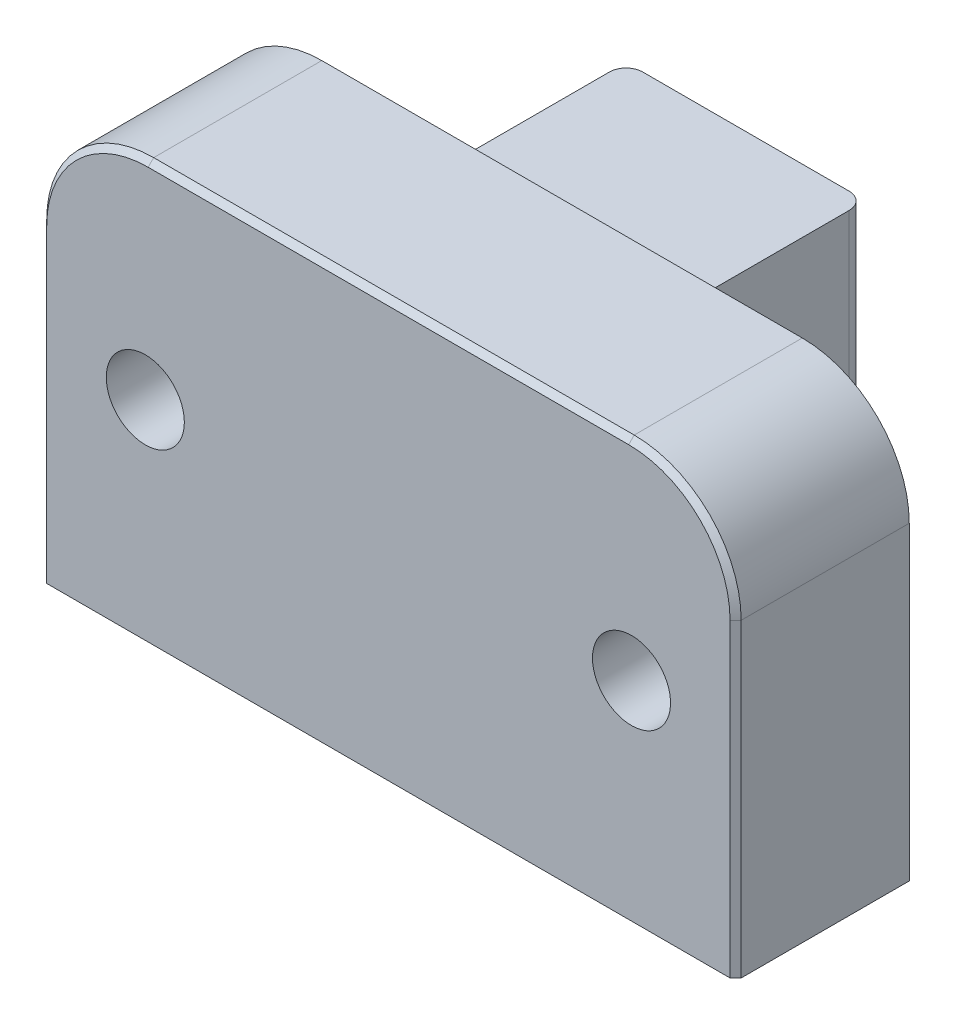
ISO-10303-21;
HEADER;
FILE_DESCRIPTION(('STEP AP214'),'2;1');
FILE_NAME('part.step','',(''),(''),'','','');
FILE_SCHEMA(('AUTOMOTIVE_DESIGN { 1 0 10303 214 1 1 1 1 }'));
ENDSEC;
DATA;
#1=APPLICATION_CONTEXT('core data for automotive mechanical design processes');
#2=APPLICATION_PROTOCOL_DEFINITION('international standard','automotive_design',2000,#1);
#3=PRODUCT_CONTEXT('',#1,'mechanical');
#4=PRODUCT('Part','Part','',(#3));
#5=PRODUCT_RELATED_PRODUCT_CATEGORY('part','',(#4));
#6=PRODUCT_DEFINITION_FORMATION('','',#4);
#7=PRODUCT_DEFINITION_CONTEXT('part definition',#1,'design');
#8=PRODUCT_DEFINITION('design','',#6,#7);
#9=PRODUCT_DEFINITION_SHAPE('','',#8);
#10=(LENGTH_UNIT() NAMED_UNIT(*) SI_UNIT(.MILLI.,.METRE.));
#11=(NAMED_UNIT(*) PLANE_ANGLE_UNIT() SI_UNIT($,.RADIAN.));
#12=(NAMED_UNIT(*) SI_UNIT($,.STERADIAN.) SOLID_ANGLE_UNIT());
#13=UNCERTAINTY_MEASURE_WITH_UNIT(LENGTH_MEASURE(1.E-05),#10,'distance_accuracy_value','');
#14=(GEOMETRIC_REPRESENTATION_CONTEXT(3) GLOBAL_UNCERTAINTY_ASSIGNED_CONTEXT((#13)) GLOBAL_UNIT_ASSIGNED_CONTEXT((#10,
#11,#12)) REPRESENTATION_CONTEXT('',''));
#15=CARTESIAN_POINT('',(0.,0.,0.));
#16=DIRECTION('',(0.,0.,1.));
#17=DIRECTION('',(1.,0.,0.));
#18=AXIS2_PLACEMENT_3D('',#15,#16,#17);
#19=CARTESIAN_POINT('',(-31.74365,38.1,0.));
#20=DIRECTION('',(1.,0.,0.));
#21=DIRECTION('',(0.,0.,-1.));
#22=AXIS2_PLACEMENT_3D('',#19,#20,#21);
#23=PLANE('',#22);
#24=DIRECTION('',(0.,0.,1.));
#25=VECTOR('',#24,1.);
#26=CARTESIAN_POINT('',(-31.74365,0.,0.));
#27=LINE('',#26,#25);
#28=CARTESIAN_POINT('',(-31.74365,0.,0.));
#29=VERTEX_POINT('',#28);
#30=CARTESIAN_POINT('',(-31.74365,0.,15.367));
#31=VERTEX_POINT('',#30);
#32=EDGE_CURVE('E178',#29,#31,#27,.T.);
#33=ORIENTED_EDGE('',*,*,#32,.T.);
#34=DIRECTION('',(0.,1.,0.));
#35=VECTOR('',#34,1.);
#36=CARTESIAN_POINT('',(-31.74365,38.1,15.367));
#37=LINE('',#36,#35);
#38=CARTESIAN_POINT('',(-31.74365,28.321,15.367));
#39=VERTEX_POINT('',#38);
#40=EDGE_CURVE('E252',#31,#39,#37,.T.);
#41=ORIENTED_EDGE('',*,*,#40,.T.);
#42=DIRECTION('',(0.,0.,1.));
#43=VECTOR('',#42,1.);
#44=CARTESIAN_POINT('',(-31.74365,28.321,0.));
#45=LINE('',#44,#43);
#46=CARTESIAN_POINT('',(-31.74365,28.321,0.));
#47=VERTEX_POINT('',#46);
#48=EDGE_CURVE('E235',#39,#47,#45,.F.);
#49=ORIENTED_EDGE('',*,*,#48,.T.);
#50=DIRECTION('',(0.,-1.,0.));
#51=VECTOR('',#50,1.);
#52=CARTESIAN_POINT('',(-31.74365,38.1,0.));
#53=LINE('',#52,#51);
#54=EDGE_CURVE('E173',#47,#29,#53,.T.);
#55=ORIENTED_EDGE('',*,*,#54,.T.);
#56=EDGE_LOOP('',(#33,#41,#49,#55));
#57=FACE_BOUND('',#56,.T.);
#58=ADVANCED_FACE('F32',(#57),#23,.F.);
#59=CARTESIAN_POINT('',(-31.74365,38.1,15.875));
#60=DIRECTION('',(0.,0.,-1.));
#61=DIRECTION('',(-1.,0.,0.));
#62=AXIS2_PLACEMENT_3D('',#59,#60,#61);
#63=PLANE('',#62);
#64=CARTESIAN_POINT('',(22.225,19.05,15.875));
#65=DIRECTION('',(0.,0.,-1.));
#66=DIRECTION('',(-1.,0.,0.));
#67=AXIS2_PLACEMENT_3D('',#64,#65,#66);
#68=CIRCLE('',#67,3.5687);
#69=CARTESIAN_POINT('',(18.6563,19.05,15.875));
#70=VERTEX_POINT('',#69);
#71=EDGE_CURVE('E284',#70,#70,#68,.T.);
#72=ORIENTED_EDGE('',*,*,#71,.T.);
#73=EDGE_LOOP('',(#72));
#74=FACE_BOUND('',#73,.T.);
#75=CARTESIAN_POINT('',(-22.225,19.05,15.875));
#76=DIRECTION('',(0.,0.,1.));
#77=DIRECTION('',(1.,0.,0.));
#78=AXIS2_PLACEMENT_3D('',#75,#76,#77);
#79=CIRCLE('',#78,3.5687);
#80=CARTESIAN_POINT('',(-18.6563,19.05,15.875));
#81=VERTEX_POINT('',#80);
#82=EDGE_CURVE('E296',#81,#81,#79,.T.);
#83=ORIENTED_EDGE('',*,*,#82,.F.);
#84=EDGE_LOOP('',(#83));
#85=FACE_BOUND('',#84,.T.);
#86=CARTESIAN_POINT('',(-21.96465,28.321,15.875));
#87=DIRECTION('',(0.,0.,-1.));
#88=DIRECTION('',(-1.,0.,0.));
#89=AXIS2_PLACEMENT_3D('',#86,#87,#88);
#90=CIRCLE('',#89,9.271);
#91=CARTESIAN_POINT('',(-21.96465,37.592,15.875));
#92=VERTEX_POINT('',#91);
#93=CARTESIAN_POINT('',(-31.23565,28.321,15.875));
#94=VERTEX_POINT('',#93);
#95=EDGE_CURVE('E243',#92,#94,#90,.F.);
#96=ORIENTED_EDGE('',*,*,#95,.T.);
#97=DIRECTION('',(0.,-1.,0.));
#98=VECTOR('',#97,1.);
#99=CARTESIAN_POINT('',(-31.23565,38.1,15.875));
#100=LINE('',#99,#98);
#101=CARTESIAN_POINT('',(-31.23565,0.,15.875));
#102=VERTEX_POINT('',#101);
#103=EDGE_CURVE('E245',#94,#102,#100,.T.);
#104=ORIENTED_EDGE('',*,*,#103,.T.);
#105=DIRECTION('',(1.,0.,0.));
#106=VECTOR('',#105,1.);
#107=CARTESIAN_POINT('',(-31.74365,0.,15.875));
#108=LINE('',#107,#106);
#109=CARTESIAN_POINT('',(31.23565,0.,15.875));
#110=VERTEX_POINT('',#109);
#111=EDGE_CURVE('E162',#102,#110,#108,.T.);
#112=ORIENTED_EDGE('',*,*,#111,.T.);
#113=DIRECTION('',(0.,1.,0.));
#114=VECTOR('',#113,1.);
#115=CARTESIAN_POINT('',(31.23565,38.1,15.875));
#116=LINE('',#115,#114);
#117=CARTESIAN_POINT('',(31.23565,28.321,15.875));
#118=VERTEX_POINT('',#117);
#119=EDGE_CURVE('E237',#110,#118,#116,.T.);
#120=ORIENTED_EDGE('',*,*,#119,.T.);
#121=CARTESIAN_POINT('',(21.96465,28.321,15.875));
#122=DIRECTION('',(0.,0.,-1.));
#123=DIRECTION('',(-1.,0.,0.));
#124=AXIS2_PLACEMENT_3D('',#121,#122,#123);
#125=CIRCLE('',#124,9.271);
#126=CARTESIAN_POINT('',(21.96465,37.592,15.875));
#127=VERTEX_POINT('',#126);
#128=EDGE_CURVE('E239',#118,#127,#125,.F.);
#129=ORIENTED_EDGE('',*,*,#128,.T.);
#130=DIRECTION('',(-1.,0.,0.));
#131=VECTOR('',#130,1.);
#132=CARTESIAN_POINT('',(-21.96465,37.592,15.875));
#133=LINE('',#132,#131);
#134=EDGE_CURVE('E241',#127,#92,#133,.T.);
#135=ORIENTED_EDGE('',*,*,#134,.T.);
#136=EDGE_LOOP('',(#96,#104,#112,#120,#129,#135));
#137=FACE_BOUND('',#136,.T.);
#138=ADVANCED_FACE('F322',(#74,#85,#137),#63,.F.);
#139=CARTESIAN_POINT('',(31.74365,38.1,0.));
#140=DIRECTION('',(-1.,0.,0.));
#141=DIRECTION('',(0.,0.,1.));
#142=AXIS2_PLACEMENT_3D('',#139,#140,#141);
#143=PLANE('',#142);
#144=DIRECTION('',(0.,0.,-1.));
#145=VECTOR('',#144,1.);
#146=CARTESIAN_POINT('',(31.74365,28.321,15.875));
#147=LINE('',#146,#145);
#148=CARTESIAN_POINT('',(31.74365,28.321,0.));
#149=VERTEX_POINT('',#148);
#150=CARTESIAN_POINT('',(31.74365,28.321,15.367));
#151=VERTEX_POINT('',#150);
#152=EDGE_CURVE('E233',#149,#151,#147,.F.);
#153=ORIENTED_EDGE('',*,*,#152,.T.);
#154=DIRECTION('',(0.,-1.,0.));
#155=VECTOR('',#154,1.);
#156=CARTESIAN_POINT('',(31.74365,38.1,15.367));
#157=LINE('',#156,#155);
#158=CARTESIAN_POINT('',(31.74365,0.,15.367));
#159=VERTEX_POINT('',#158);
#160=EDGE_CURVE('E11',#151,#159,#157,.T.);
#161=ORIENTED_EDGE('',*,*,#160,.T.);
#162=DIRECTION('',(0.,0.,-1.));
#163=VECTOR('',#162,1.);
#164=CARTESIAN_POINT('',(31.74365,0.,0.));
#165=LINE('',#164,#163);
#166=CARTESIAN_POINT('',(31.74365,0.,0.));
#167=VERTEX_POINT('',#166);
#168=EDGE_CURVE('E153',#159,#167,#165,.T.);
#169=ORIENTED_EDGE('',*,*,#168,.T.);
#170=DIRECTION('',(0.,-1.,0.));
#171=VECTOR('',#170,1.);
#172=CARTESIAN_POINT('',(31.74365,38.1,0.));
#173=LINE('',#172,#171);
#174=EDGE_CURVE('E156',#149,#167,#173,.T.);
#175=ORIENTED_EDGE('',*,*,#174,.F.);
#176=EDGE_LOOP('',(#153,#161,#169,#175));
#177=FACE_BOUND('',#176,.T.);
#178=ADVANCED_FACE('F155',(#177),#143,.F.);
#179=CARTESIAN_POINT('',(10.9601,38.1,-16.8148));
#180=DIRECTION('',(-1.,0.,0.));
#181=DIRECTION('',(0.,0.,1.));
#182=AXIS2_PLACEMENT_3D('',#179,#180,#181);
#183=PLANE('',#182);
#184=DIRECTION('',(0.,0.,1.));
#185=VECTOR('',#184,1.);
#186=CARTESIAN_POINT('',(10.9601,35.052,-16.8148));
#187=LINE('',#186,#185);
#188=CARTESIAN_POINT('',(10.9601,35.052,-15.2908));
#189=VERTEX_POINT('',#188);
#190=CARTESIAN_POINT('',(10.9601,35.052,-0.787400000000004));
#191=VERTEX_POINT('',#190);
#192=EDGE_CURVE('E306',#189,#191,#187,.T.);
#193=ORIENTED_EDGE('',*,*,#192,.T.);
#194=DIRECTION('',(0.,-1.,0.));
#195=VECTOR('',#194,1.);
#196=CARTESIAN_POINT('',(10.9601,3.048,-0.787400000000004));
#197=LINE('',#196,#195);
#198=CARTESIAN_POINT('',(10.9601,3.048,-0.787400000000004));
#199=VERTEX_POINT('',#198);
#200=EDGE_CURVE('E213',#191,#199,#197,.T.);
#201=ORIENTED_EDGE('',*,*,#200,.T.);
#202=DIRECTION('',(0.,0.,-1.));
#203=VECTOR('',#202,1.);
#204=CARTESIAN_POINT('',(10.9601,3.048,-16.8148));
#205=LINE('',#204,#203);
#206=CARTESIAN_POINT('',(10.9601,3.048,-15.2908));
#207=VERTEX_POINT('',#206);
#208=EDGE_CURVE('E317',#199,#207,#205,.T.);
#209=ORIENTED_EDGE('',*,*,#208,.T.);
#210=DIRECTION('',(0.,-1.,0.));
#211=VECTOR('',#210,1.);
#212=CARTESIAN_POINT('',(10.9601,38.1,-15.2908));
#213=LINE('',#212,#211);
#214=EDGE_CURVE('E195',#207,#189,#213,.F.);
#215=ORIENTED_EDGE('',*,*,#214,.T.);
#216=EDGE_LOOP('',(#193,#201,#209,#215));
#217=FACE_BOUND('',#216,.T.);
#218=ADVANCED_FACE('F400',(#217),#183,.F.);
#219=CARTESIAN_POINT('',(-10.9601,38.1,-16.8148));
#220=DIRECTION('',(0.,0.,1.));
#221=DIRECTION('',(1.,0.,0.));
#222=AXIS2_PLACEMENT_3D('',#219,#220,#221);
#223=PLANE('',#222);
#224=DIRECTION('',(1.,0.,0.));
#225=VECTOR('',#224,1.);
#226=CARTESIAN_POINT('',(-10.9601,35.052,-16.8148));
#227=LINE('',#226,#225);
#228=CARTESIAN_POINT('',(-9.43609999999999,35.052,-16.8148));
#229=VERTEX_POINT('',#228);
#230=CARTESIAN_POINT('',(9.43610000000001,35.052,-16.8148));
#231=VERTEX_POINT('',#230);
#232=EDGE_CURVE('E303',#229,#231,#227,.T.);
#233=ORIENTED_EDGE('',*,*,#232,.T.);
#234=DIRECTION('',(0.,-1.,0.));
#235=VECTOR('',#234,1.);
#236=CARTESIAN_POINT('',(9.43610000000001,38.1,-16.8148));
#237=LINE('',#236,#235);
#238=CARTESIAN_POINT('',(9.43610000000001,3.048,-16.8148));
#239=VERTEX_POINT('',#238);
#240=EDGE_CURVE('E187',#231,#239,#237,.T.);
#241=ORIENTED_EDGE('',*,*,#240,.T.);
#242=DIRECTION('',(-1.,0.,0.));
#243=VECTOR('',#242,1.);
#244=CARTESIAN_POINT('',(-10.9601,3.048,-16.8148));
#245=LINE('',#244,#243);
#246=CARTESIAN_POINT('',(-9.43609999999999,3.048,-16.8148));
#247=VERTEX_POINT('',#246);
#248=EDGE_CURVE('E314',#239,#247,#245,.T.);
#249=ORIENTED_EDGE('',*,*,#248,.T.);
#250=DIRECTION('',(0.,-1.,0.));
#251=VECTOR('',#250,1.);
#252=CARTESIAN_POINT('',(-9.43609999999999,38.1,-16.8148));
#253=LINE('',#252,#251);
#254=EDGE_CURVE('E172',#247,#229,#253,.F.);
#255=ORIENTED_EDGE('',*,*,#254,.T.);
#256=EDGE_LOOP('',(#233,#241,#249,#255));
#257=FACE_BOUND('',#256,.T.);
#258=ADVANCED_FACE('F405',(#257),#223,.F.);
#259=CARTESIAN_POINT('',(-10.9601,38.1,-16.8148));
#260=DIRECTION('',(1.,0.,0.));
#261=DIRECTION('',(0.,0.,-1.));
#262=AXIS2_PLACEMENT_3D('',#259,#260,#261);
#263=PLANE('',#262);
#264=DIRECTION('',(0.,0.,1.));
#265=VECTOR('',#264,1.);
#266=CARTESIAN_POINT('',(-10.9601,3.048,-16.8148));
#267=LINE('',#266,#265);
#268=CARTESIAN_POINT('',(-10.9601,3.048,-15.2908));
#269=VERTEX_POINT('',#268);
#270=CARTESIAN_POINT('',(-10.9601,3.048,-0.787400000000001));
#271=VERTEX_POINT('',#270);
#272=EDGE_CURVE('E311',#269,#271,#267,.T.);
#273=ORIENTED_EDGE('',*,*,#272,.T.);
#274=DIRECTION('',(0.,-1.,0.));
#275=VECTOR('',#274,1.);
#276=CARTESIAN_POINT('',(-10.9601,35.052,-0.787399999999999));
#277=LINE('',#276,#275);
#278=CARTESIAN_POINT('',(-10.9601,35.052,-0.787400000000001));
#279=VERTEX_POINT('',#278);
#280=EDGE_CURVE('E211',#271,#279,#277,.F.);
#281=ORIENTED_EDGE('',*,*,#280,.T.);
#282=DIRECTION('',(0.,0.,-1.));
#283=VECTOR('',#282,1.);
#284=CARTESIAN_POINT('',(-10.9601,35.052,-16.8148));
#285=LINE('',#284,#283);
#286=CARTESIAN_POINT('',(-10.9601,35.052,-15.2908));
#287=VERTEX_POINT('',#286);
#288=EDGE_CURVE('E301',#279,#287,#285,.T.);
#289=ORIENTED_EDGE('',*,*,#288,.T.);
#290=DIRECTION('',(0.,-1.,0.));
#291=VECTOR('',#290,1.);
#292=CARTESIAN_POINT('',(-10.9601,38.1,-15.2908));
#293=LINE('',#292,#291);
#294=EDGE_CURVE('E202',#287,#269,#293,.T.);
#295=ORIENTED_EDGE('',*,*,#294,.T.);
#296=EDGE_LOOP('',(#273,#281,#289,#295));
#297=FACE_BOUND('',#296,.T.);
#298=ADVANCED_FACE('F389',(#297),#263,.F.);
#299=CARTESIAN_POINT('',(-31.74365,38.1,0.));
#300=DIRECTION('',(0.,0.,1.));
#301=DIRECTION('',(1.,0.,0.));
#302=AXIS2_PLACEMENT_3D('',#299,#300,#301);
#303=PLANE('',#302);
#304=CARTESIAN_POINT('',(22.225,19.05,0.));
#305=DIRECTION('',(0.,0.,-1.));
#306=DIRECTION('',(-1.,0.,0.));
#307=AXIS2_PLACEMENT_3D('',#304,#305,#306);
#308=CIRCLE('',#307,5.1562);
#309=CARTESIAN_POINT('',(17.0688,19.05,0.));
#310=VERTEX_POINT('',#309);
#311=EDGE_CURVE('E269',#310,#310,#308,.T.);
#312=ORIENTED_EDGE('',*,*,#311,.F.);
#313=EDGE_LOOP('',(#312));
#314=FACE_BOUND('',#313,.T.);
#315=CARTESIAN_POINT('',(-22.225,19.05,0.));
#316=DIRECTION('',(0.,0.,1.));
#317=DIRECTION('',(1.,0.,0.));
#318=AXIS2_PLACEMENT_3D('',#315,#316,#317);
#319=CIRCLE('',#318,5.1562);
#320=CARTESIAN_POINT('',(-17.0688,19.05,0.));
#321=VERTEX_POINT('',#320);
#322=EDGE_CURVE('E287',#321,#321,#319,.T.);
#323=ORIENTED_EDGE('',*,*,#322,.T.);
#324=EDGE_LOOP('',(#323));
#325=FACE_BOUND('',#324,.T.);
#326=DIRECTION('',(0.,-1.,0.));
#327=VECTOR('',#326,1.);
#328=CARTESIAN_POINT('',(-11.7475,3.048,0.));
#329=LINE('',#328,#327);
#330=CARTESIAN_POINT('',(-11.7475,35.052,0.));
#331=VERTEX_POINT('',#330);
#332=CARTESIAN_POINT('',(-11.7475,3.048,0.));
#333=VERTEX_POINT('',#332);
#334=EDGE_CURVE('E208',#331,#333,#329,.T.);
#335=ORIENTED_EDGE('',*,*,#334,.T.);
#336=DIRECTION('',(1.,0.,0.));
#337=VECTOR('',#336,1.);
#338=CARTESIAN_POINT('',(-25.4,3.048,0.));
#339=LINE('',#338,#337);
#340=CARTESIAN_POINT('',(11.7475,3.048,0.));
#341=VERTEX_POINT('',#340);
#342=EDGE_CURVE('E309',#333,#341,#339,.T.);
#343=ORIENTED_EDGE('',*,*,#342,.T.);
#344=DIRECTION('',(0.,-1.,0.));
#345=VECTOR('',#344,1.);
#346=CARTESIAN_POINT('',(11.7475,35.052,0.));
#347=LINE('',#346,#345);
#348=CARTESIAN_POINT('',(11.7475,35.052,0.));
#349=VERTEX_POINT('',#348);
#350=EDGE_CURVE('E205',#341,#349,#347,.F.);
#351=ORIENTED_EDGE('',*,*,#350,.T.);
#352=DIRECTION('',(1.,0.,0.));
#353=VECTOR('',#352,1.);
#354=CARTESIAN_POINT('',(-25.4,35.052,0.));
#355=LINE('',#354,#353);
#356=EDGE_CURVE('E299',#331,#349,#355,.T.);
#357=ORIENTED_EDGE('',*,*,#356,.F.);
#358=EDGE_LOOP('',(#335,#343,#351,#357));
#359=FACE_BOUND('',#358,.T.);
#360=DIRECTION('',(-1.,0.,0.));
#361=VECTOR('',#360,1.);
#362=CARTESIAN_POINT('',(10.9601,38.1,0.));
#363=LINE('',#362,#361);
#364=CARTESIAN_POINT('',(21.96465,38.1,0.));
#365=VERTEX_POINT('',#364);
#366=CARTESIAN_POINT('',(-21.96465,38.1,0.));
#367=VERTEX_POINT('',#366);
#368=EDGE_CURVE('E179',#365,#367,#363,.T.);
#369=ORIENTED_EDGE('',*,*,#368,.F.);
#370=CARTESIAN_POINT('',(21.96465,28.321,0.));
#371=DIRECTION('',(0.,0.,1.));
#372=DIRECTION('',(1.,0.,0.));
#373=AXIS2_PLACEMENT_3D('',#370,#371,#372);
#374=CIRCLE('',#373,9.779);
#375=EDGE_CURVE('E171',#365,#149,#374,.F.);
#376=ORIENTED_EDGE('',*,*,#375,.T.);
#377=ORIENTED_EDGE('',*,*,#174,.T.);
#378=DIRECTION('',(-1.,0.,0.));
#379=VECTOR('',#378,1.);
#380=CARTESIAN_POINT('',(-31.74365,0.,0.));
#381=LINE('',#380,#379);
#382=EDGE_CURVE('E161',#167,#29,#381,.T.);
#383=ORIENTED_EDGE('',*,*,#382,.T.);
#384=ORIENTED_EDGE('',*,*,#54,.F.);
#385=CARTESIAN_POINT('',(-21.96465,28.321,0.));
#386=DIRECTION('',(0.,0.,1.));
#387=DIRECTION('',(1.,0.,0.));
#388=AXIS2_PLACEMENT_3D('',#385,#386,#387);
#389=CIRCLE('',#388,9.779);
#390=EDGE_CURVE('E230',#47,#367,#389,.F.);
#391=ORIENTED_EDGE('',*,*,#390,.T.);
#392=EDGE_LOOP('',(#369,#376,#377,#383,#384,#391));
#393=FACE_BOUND('',#392,.T.);
#394=ADVANCED_FACE('F167',(#314,#325,#359,#393),#303,.F.);
#395=CARTESIAN_POINT('',(-31.74365,38.1,15.875));
#396=DIRECTION('',(0.,1.,0.));
#397=DIRECTION('',(0.,0.,1.));
#398=AXIS2_PLACEMENT_3D('',#395,#396,#397);
#399=PLANE('',#398);
#400=DIRECTION('',(0.,0.,1.));
#401=VECTOR('',#400,1.);
#402=CARTESIAN_POINT('',(-21.96465,38.1,15.875));
#403=LINE('',#402,#401);
#404=CARTESIAN_POINT('',(-21.96465,38.1,15.367));
#405=VERTEX_POINT('',#404);
#406=EDGE_CURVE('E226',#367,#405,#403,.T.);
#407=ORIENTED_EDGE('',*,*,#406,.T.);
#408=DIRECTION('',(1.,0.,0.));
#409=VECTOR('',#408,1.);
#410=CARTESIAN_POINT('',(21.96465,38.1,15.367));
#411=LINE('',#410,#409);
#412=CARTESIAN_POINT('',(21.96465,38.1,15.367));
#413=VERTEX_POINT('',#412);
#414=EDGE_CURVE('E56',#405,#413,#411,.T.);
#415=ORIENTED_EDGE('',*,*,#414,.T.);
#416=DIRECTION('',(0.,0.,-1.));
#417=VECTOR('',#416,1.);
#418=CARTESIAN_POINT('',(21.96465,38.1,0.));
#419=LINE('',#418,#417);
#420=EDGE_CURVE('E228',#413,#365,#419,.T.);
#421=ORIENTED_EDGE('',*,*,#420,.T.);
#422=ORIENTED_EDGE('',*,*,#368,.T.);
#423=EDGE_LOOP('',(#407,#415,#421,#422));
#424=FACE_BOUND('',#423,.T.);
#425=ADVANCED_FACE('F342',(#424),#399,.T.);
#426=CARTESIAN_POINT('',(-31.74365,0.,15.875));
#427=DIRECTION('',(0.,1.,0.));
#428=DIRECTION('',(0.,0.,1.));
#429=AXIS2_PLACEMENT_3D('',#426,#427,#428);
#430=PLANE('',#429);
#431=ORIENTED_EDGE('',*,*,#111,.F.);
#432=DIRECTION('',(0.707106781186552,0.,0.707106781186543));
#433=VECTOR('',#432,1.);
#434=CARTESIAN_POINT('',(-31.23565,0.,15.875));
#435=LINE('',#434,#433);
#436=EDGE_CURVE('E250',#102,#31,#435,.F.);
#437=ORIENTED_EDGE('',*,*,#436,.T.);
#438=ORIENTED_EDGE('',*,*,#32,.F.);
#439=ORIENTED_EDGE('',*,*,#382,.F.);
#440=ORIENTED_EDGE('',*,*,#168,.F.);
#441=DIRECTION('',(0.707106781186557,0.,-0.707106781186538));
#442=VECTOR('',#441,1.);
#443=CARTESIAN_POINT('',(31.74365,0.,15.367));
#444=LINE('',#443,#442);
#445=EDGE_CURVE('E248',#159,#110,#444,.F.);
#446=ORIENTED_EDGE('',*,*,#445,.T.);
#447=EDGE_LOOP('',(#431,#437,#438,#439,#440,#446));
#448=FACE_BOUND('',#447,.T.);
#449=ADVANCED_FACE('F176',(#448),#430,.F.);
#450=CARTESIAN_POINT('',(-25.4,3.048,-50.8));
#451=DIRECTION('',(0.,1.,0.));
#452=DIRECTION('',(0.,0.,1.));
#453=AXIS2_PLACEMENT_3D('',#450,#451,#452);
#454=PLANE('',#453);
#455=ORIENTED_EDGE('',*,*,#248,.F.);
#456=CARTESIAN_POINT('',(9.43610000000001,3.048,-15.2908));
#457=DIRECTION('',(0.,1.,0.));
#458=DIRECTION('',(0.,0.,1.));
#459=AXIS2_PLACEMENT_3D('',#456,#457,#458);
#460=CIRCLE('',#459,1.524);
#461=EDGE_CURVE('E192',#239,#207,#460,.F.);
#462=ORIENTED_EDGE('',*,*,#461,.T.);
#463=ORIENTED_EDGE('',*,*,#208,.F.);
#464=CARTESIAN_POINT('',(11.7475,3.048,-0.787400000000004));
#465=DIRECTION('',(0.,1.,0.));
#466=DIRECTION('',(0.,0.,1.));
#467=AXIS2_PLACEMENT_3D('',#464,#465,#466);
#468=CIRCLE('',#467,0.7874);
#469=EDGE_CURVE('E221',#199,#341,#468,.T.);
#470=ORIENTED_EDGE('',*,*,#469,.T.);
#471=ORIENTED_EDGE('',*,*,#342,.F.);
#472=CARTESIAN_POINT('',(-11.7475,3.048,-0.7874));
#473=DIRECTION('',(0.,1.,0.));
#474=DIRECTION('',(0.,0.,1.));
#475=AXIS2_PLACEMENT_3D('',#472,#473,#474);
#476=CIRCLE('',#475,0.7874);
#477=EDGE_CURVE('E216',#333,#271,#476,.T.);
#478=ORIENTED_EDGE('',*,*,#477,.T.);
#479=ORIENTED_EDGE('',*,*,#272,.F.);
#480=CARTESIAN_POINT('',(-9.43609999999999,3.048,-15.2908));
#481=DIRECTION('',(0.,1.,0.));
#482=DIRECTION('',(0.,0.,1.));
#483=AXIS2_PLACEMENT_3D('',#480,#481,#482);
#484=CIRCLE('',#483,1.524);
#485=EDGE_CURVE('E190',#269,#247,#484,.F.);
#486=ORIENTED_EDGE('',*,*,#485,.T.);
#487=EDGE_LOOP('',(#455,#462,#463,#470,#471,#478,#479,#486));
#488=FACE_BOUND('',#487,.T.);
#489=ADVANCED_FACE('F393',(#488),#454,.F.);
#490=CARTESIAN_POINT('',(-25.4,35.052,-50.8));
#491=DIRECTION('',(0.,-1.,0.));
#492=DIRECTION('',(0.,0.,-1.));
#493=AXIS2_PLACEMENT_3D('',#490,#491,#492);
#494=PLANE('',#493);
#495=ORIENTED_EDGE('',*,*,#192,.F.);
#496=CARTESIAN_POINT('',(9.43610000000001,35.052,-15.2908));
#497=DIRECTION('',(0.,-1.,0.));
#498=DIRECTION('',(0.,0.,-1.));
#499=AXIS2_PLACEMENT_3D('',#496,#497,#498);
#500=CIRCLE('',#499,1.524);
#501=EDGE_CURVE('E200',#189,#231,#500,.F.);
#502=ORIENTED_EDGE('',*,*,#501,.T.);
#503=ORIENTED_EDGE('',*,*,#232,.F.);
#504=CARTESIAN_POINT('',(-9.43609999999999,35.052,-15.2908));
#505=DIRECTION('',(0.,-1.,0.));
#506=DIRECTION('',(0.,0.,-1.));
#507=AXIS2_PLACEMENT_3D('',#504,#505,#506);
#508=CIRCLE('',#507,1.524);
#509=EDGE_CURVE('E197',#229,#287,#508,.F.);
#510=ORIENTED_EDGE('',*,*,#509,.T.);
#511=ORIENTED_EDGE('',*,*,#288,.F.);
#512=CARTESIAN_POINT('',(-11.7475,35.052,-0.7874));
#513=DIRECTION('',(0.,-1.,0.));
#514=DIRECTION('',(0.,0.,-1.));
#515=AXIS2_PLACEMENT_3D('',#512,#513,#514);
#516=CIRCLE('',#515,0.7874);
#517=EDGE_CURVE('E218',#279,#331,#516,.T.);
#518=ORIENTED_EDGE('',*,*,#517,.T.);
#519=ORIENTED_EDGE('',*,*,#356,.T.);
#520=CARTESIAN_POINT('',(11.7475,35.052,-0.787400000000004));
#521=DIRECTION('',(0.,-1.,0.));
#522=DIRECTION('',(0.,0.,-1.));
#523=AXIS2_PLACEMENT_3D('',#520,#521,#522);
#524=CIRCLE('',#523,0.7874);
#525=EDGE_CURVE('E224',#349,#191,#524,.T.);
#526=ORIENTED_EDGE('',*,*,#525,.T.);
#527=EDGE_LOOP('',(#495,#502,#503,#510,#511,#518,#519,#526));
#528=FACE_BOUND('',#527,.T.);
#529=ADVANCED_FACE('F369',(#528),#494,.F.);
#530=CARTESIAN_POINT('',(9.43610000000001,38.1,-15.2908));
#531=DIRECTION('',(0.,-1.,0.));
#532=DIRECTION('',(0.,0.,-1.));
#533=AXIS2_PLACEMENT_3D('',#530,#531,#532);
#534=CYLINDRICAL_SURFACE('',#533,1.524);
#535=ORIENTED_EDGE('',*,*,#501,.F.);
#536=ORIENTED_EDGE('',*,*,#214,.F.);
#537=ORIENTED_EDGE('',*,*,#461,.F.);
#538=ORIENTED_EDGE('',*,*,#240,.F.);
#539=EDGE_LOOP('',(#535,#536,#537,#538));
#540=FACE_BOUND('',#539,.T.);
#541=ADVANCED_FACE('F365',(#540),#534,.T.);
#542=CARTESIAN_POINT('',(-9.43609999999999,38.1,-15.2908));
#543=DIRECTION('',(0.,-1.,0.));
#544=DIRECTION('',(0.,0.,-1.));
#545=AXIS2_PLACEMENT_3D('',#542,#543,#544);
#546=CYLINDRICAL_SURFACE('',#545,1.524);
#547=ORIENTED_EDGE('',*,*,#509,.F.);
#548=ORIENTED_EDGE('',*,*,#254,.F.);
#549=ORIENTED_EDGE('',*,*,#485,.F.);
#550=ORIENTED_EDGE('',*,*,#294,.F.);
#551=EDGE_LOOP('',(#547,#548,#549,#550));
#552=FACE_BOUND('',#551,.T.);
#553=ADVANCED_FACE('F368',(#552),#546,.T.);
#554=CARTESIAN_POINT('',(-11.7475,38.1,-0.7874));
#555=DIRECTION('',(0.,1.,0.));
#556=DIRECTION('',(0.,0.,1.));
#557=AXIS2_PLACEMENT_3D('',#554,#555,#556);
#558=CYLINDRICAL_SURFACE('',#557,0.7874);
#559=ORIENTED_EDGE('',*,*,#517,.F.);
#560=ORIENTED_EDGE('',*,*,#280,.F.);
#561=ORIENTED_EDGE('',*,*,#477,.F.);
#562=ORIENTED_EDGE('',*,*,#334,.F.);
#563=EDGE_LOOP('',(#559,#560,#561,#562));
#564=FACE_BOUND('',#563,.T.);
#565=ADVANCED_FACE('F353',(#564),#558,.F.);
#566=CARTESIAN_POINT('',(11.7475,38.1,-0.787400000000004));
#567=DIRECTION('',(0.,1.,0.));
#568=DIRECTION('',(0.,0.,1.));
#569=AXIS2_PLACEMENT_3D('',#566,#567,#568);
#570=CYLINDRICAL_SURFACE('',#569,0.7874);
#571=ORIENTED_EDGE('',*,*,#525,.F.);
#572=ORIENTED_EDGE('',*,*,#350,.F.);
#573=ORIENTED_EDGE('',*,*,#469,.F.);
#574=ORIENTED_EDGE('',*,*,#200,.F.);
#575=EDGE_LOOP('',(#571,#572,#573,#574));
#576=FACE_BOUND('',#575,.T.);
#577=ADVANCED_FACE('F345',(#576),#570,.F.);
#578=CARTESIAN_POINT('',(21.96465,28.321,15.875));
#579=DIRECTION('',(0.,0.,1.));
#580=DIRECTION('',(1.,0.,0.));
#581=AXIS2_PLACEMENT_3D('',#578,#579,#580);
#582=CYLINDRICAL_SURFACE('',#581,9.779);
#583=ORIENTED_EDGE('',*,*,#420,.F.);
#584=CARTESIAN_POINT('',(21.96465,28.321,15.367));
#585=DIRECTION('',(0.,0.,-1.));
#586=DIRECTION('',(-1.,0.,0.));
#587=AXIS2_PLACEMENT_3D('',#584,#585,#586);
#588=CIRCLE('',#587,9.779);
#589=EDGE_CURVE('E41',#413,#151,#588,.T.);
#590=ORIENTED_EDGE('',*,*,#589,.T.);
#591=ORIENTED_EDGE('',*,*,#152,.F.);
#592=ORIENTED_EDGE('',*,*,#375,.F.);
#593=EDGE_LOOP('',(#583,#590,#591,#592));
#594=FACE_BOUND('',#593,.T.);
#595=ADVANCED_FACE('F343',(#594),#582,.T.);
#596=CARTESIAN_POINT('',(-21.96465,28.321,15.875));
#597=DIRECTION('',(0.,0.,-1.));
#598=DIRECTION('',(-1.,0.,0.));
#599=AXIS2_PLACEMENT_3D('',#596,#597,#598);
#600=CYLINDRICAL_SURFACE('',#599,9.779);
#601=ORIENTED_EDGE('',*,*,#48,.F.);
#602=CARTESIAN_POINT('',(-21.96465,28.321,15.367));
#603=DIRECTION('',(0.,0.,-1.));
#604=DIRECTION('',(-1.,0.,0.));
#605=AXIS2_PLACEMENT_3D('',#602,#603,#604);
#606=CIRCLE('',#605,9.779);
#607=EDGE_CURVE('E254',#39,#405,#606,.T.);
#608=ORIENTED_EDGE('',*,*,#607,.T.);
#609=ORIENTED_EDGE('',*,*,#406,.F.);
#610=ORIENTED_EDGE('',*,*,#390,.F.);
#611=EDGE_LOOP('',(#601,#608,#609,#610));
#612=FACE_BOUND('',#611,.T.);
#613=ADVANCED_FACE('F341',(#612),#600,.T.);
#614=CARTESIAN_POINT('',(-22.225,19.05,26.865158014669));
#615=DIRECTION('',(0.,0.,1.));
#616=DIRECTION('',(1.,0.,0.));
#617=AXIS2_PLACEMENT_3D('',#614,#615,#616);
#618=CYLINDRICAL_SURFACE('',#617,3.5687);
#619=CARTESIAN_POINT('',(-22.225,19.05,6.7564));
#620=DIRECTION('',(0.,0.,1.));
#621=DIRECTION('',(1.,0.,0.));
#622=AXIS2_PLACEMENT_3D('',#619,#620,#621);
#623=CIRCLE('',#622,3.5687);
#624=CARTESIAN_POINT('',(-18.6563,19.05,6.7564));
#625=VERTEX_POINT('',#624);
#626=EDGE_CURVE('E293',#625,#625,#623,.T.);
#627=ORIENTED_EDGE('',*,*,#626,.F.);
#628=EDGE_LOOP('',(#627));
#629=FACE_BOUND('',#628,.T.);
#630=ORIENTED_EDGE('',*,*,#82,.T.);
#631=EDGE_LOOP('',(#630));
#632=FACE_BOUND('',#631,.T.);
#633=ADVANCED_FACE('F351',(#629,#632),#618,.F.);
#634=CARTESIAN_POINT('',(-18.6563,19.05,6.7564));
#635=DIRECTION('',(0.,0.,1.));
#636=DIRECTION('',(1.,0.,0.));
#637=AXIS2_PLACEMENT_3D('',#634,#635,#636);
#638=PLANE('',#637);
#639=CARTESIAN_POINT('',(-22.225,19.05,6.7564));
#640=DIRECTION('',(0.,0.,1.));
#641=DIRECTION('',(1.,0.,0.));
#642=AXIS2_PLACEMENT_3D('',#639,#640,#641);
#643=CIRCLE('',#642,5.1562);
#644=CARTESIAN_POINT('',(-17.0688,19.05,6.7564));
#645=VERTEX_POINT('',#644);
#646=EDGE_CURVE('E290',#645,#645,#643,.T.);
#647=ORIENTED_EDGE('',*,*,#646,.F.);
#648=EDGE_LOOP('',(#647));
#649=FACE_BOUND('',#648,.T.);
#650=ORIENTED_EDGE('',*,*,#626,.T.);
#651=EDGE_LOOP('',(#650));
#652=FACE_BOUND('',#651,.T.);
#653=ADVANCED_FACE('F478',(#649,#652),#638,.F.);
#654=CARTESIAN_POINT('',(-22.225,19.05,26.865158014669));
#655=DIRECTION('',(0.,0.,1.));
#656=DIRECTION('',(1.,0.,0.));
#657=AXIS2_PLACEMENT_3D('',#654,#655,#656);
#658=CYLINDRICAL_SURFACE('',#657,5.1562);
#659=ORIENTED_EDGE('',*,*,#322,.F.);
#660=EDGE_LOOP('',(#659));
#661=FACE_BOUND('',#660,.T.);
#662=ORIENTED_EDGE('',*,*,#646,.T.);
#663=EDGE_LOOP('',(#662));
#664=FACE_BOUND('',#663,.T.);
#665=ADVANCED_FACE('F489',(#661,#664),#658,.F.);
#666=CARTESIAN_POINT('',(22.225,19.05,26.865158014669));
#667=DIRECTION('',(0.,0.,1.));
#668=DIRECTION('',(-1.,0.,0.));
#669=AXIS2_PLACEMENT_3D('',#666,#667,#668);
#670=CYLINDRICAL_SURFACE('',#669,3.5687);
#671=CARTESIAN_POINT('',(22.225,19.05,6.7564));
#672=DIRECTION('',(0.,0.,-1.));
#673=DIRECTION('',(-1.,0.,0.));
#674=AXIS2_PLACEMENT_3D('',#671,#672,#673);
#675=CIRCLE('',#674,3.5687);
#676=CARTESIAN_POINT('',(18.6563,19.05,6.7564));
#677=VERTEX_POINT('',#676);
#678=EDGE_CURVE('E279',#677,#677,#675,.T.);
#679=ORIENTED_EDGE('',*,*,#678,.T.);
#680=EDGE_LOOP('',(#679));
#681=FACE_BOUND('',#680,.T.);
#682=ORIENTED_EDGE('',*,*,#71,.F.);
#683=EDGE_LOOP('',(#682));
#684=FACE_BOUND('',#683,.T.);
#685=ADVANCED_FACE('F499',(#681,#684),#670,.F.);
#686=CARTESIAN_POINT('',(18.6563,19.05,6.7564));
#687=DIRECTION('',(0.,0.,1.));
#688=DIRECTION('',(-1.,0.,0.));
#689=AXIS2_PLACEMENT_3D('',#686,#687,#688);
#690=PLANE('',#689);
#691=CARTESIAN_POINT('',(22.225,19.05,6.7564));
#692=DIRECTION('',(0.,0.,-1.));
#693=DIRECTION('',(-1.,0.,0.));
#694=AXIS2_PLACEMENT_3D('',#691,#692,#693);
#695=CIRCLE('',#694,5.1562);
#696=CARTESIAN_POINT('',(17.0688,19.05,6.7564));
#697=VERTEX_POINT('',#696);
#698=EDGE_CURVE('E274',#697,#697,#695,.T.);
#699=ORIENTED_EDGE('',*,*,#698,.T.);
#700=EDGE_LOOP('',(#699));
#701=FACE_BOUND('',#700,.T.);
#702=ORIENTED_EDGE('',*,*,#678,.F.);
#703=EDGE_LOOP('',(#702));
#704=FACE_BOUND('',#703,.T.);
#705=ADVANCED_FACE('F517',(#701,#704),#690,.F.);
#706=CARTESIAN_POINT('',(22.225,19.05,26.865158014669));
#707=DIRECTION('',(0.,0.,1.));
#708=DIRECTION('',(-1.,0.,0.));
#709=AXIS2_PLACEMENT_3D('',#706,#707,#708);
#710=CYLINDRICAL_SURFACE('',#709,5.1562);
#711=ORIENTED_EDGE('',*,*,#311,.T.);
#712=EDGE_LOOP('',(#711));
#713=FACE_BOUND('',#712,.T.);
#714=ORIENTED_EDGE('',*,*,#698,.F.);
#715=EDGE_LOOP('',(#714));
#716=FACE_BOUND('',#715,.T.);
#717=ADVANCED_FACE('F527',(#713,#716),#710,.F.);
#718=CARTESIAN_POINT('',(31.74365,38.1,15.367));
#719=DIRECTION('',(-0.707106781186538,0.,-0.707106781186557));
#720=DIRECTION('',(-0.707106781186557,0.,0.707106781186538));
#721=AXIS2_PLACEMENT_3D('',#718,#719,#720);
#722=PLANE('',#721);
#723=ORIENTED_EDGE('',*,*,#445,.F.);
#724=ORIENTED_EDGE('',*,*,#160,.F.);
#725=DIRECTION('',(0.707106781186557,0.,-0.707106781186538));
#726=VECTOR('',#725,1.);
#727=CARTESIAN_POINT('',(31.23565,28.321,15.875));
#728=LINE('',#727,#726);
#729=EDGE_CURVE('E36',#118,#151,#728,.T.);
#730=ORIENTED_EDGE('',*,*,#729,.F.);
#731=ORIENTED_EDGE('',*,*,#119,.F.);
#732=EDGE_LOOP('',(#723,#724,#730,#731));
#733=FACE_BOUND('',#732,.T.);
#734=ADVANCED_FACE('F34',(#733),#722,.F.);
#735=CARTESIAN_POINT('',(21.96465,28.321,15.875));
#736=DIRECTION('',(0.,0.,-1.));
#737=DIRECTION('',(-1.,0.,0.));
#738=AXIS2_PLACEMENT_3D('',#735,#736,#737);
#739=CONICAL_SURFACE('',#738,9.271,0.785398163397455);
#740=ORIENTED_EDGE('',*,*,#729,.T.);
#741=ORIENTED_EDGE('',*,*,#589,.F.);
#742=DIRECTION('',(0.,0.707106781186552,-0.707106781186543));
#743=VECTOR('',#742,1.);
#744=CARTESIAN_POINT('',(21.96465,37.592,15.875));
#745=LINE('',#744,#743);
#746=EDGE_CURVE('E263',#127,#413,#745,.T.);
#747=ORIENTED_EDGE('',*,*,#746,.F.);
#748=ORIENTED_EDGE('',*,*,#128,.F.);
#749=EDGE_LOOP('',(#740,#741,#747,#748));
#750=FACE_BOUND('',#749,.T.);
#751=ADVANCED_FACE('F325',(#750),#739,.T.);
#752=CARTESIAN_POINT('',(-31.74365,38.1,15.367));
#753=DIRECTION('',(0.,0.707106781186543,0.707106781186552));
#754=DIRECTION('',(0.,-0.707106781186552,0.707106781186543));
#755=AXIS2_PLACEMENT_3D('',#752,#753,#754);
#756=PLANE('',#755);
#757=ORIENTED_EDGE('',*,*,#746,.T.);
#758=ORIENTED_EDGE('',*,*,#414,.F.);
#759=DIRECTION('',(0.,0.707106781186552,-0.707106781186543));
#760=VECTOR('',#759,1.);
#761=CARTESIAN_POINT('',(-21.96465,37.592,15.875));
#762=LINE('',#761,#760);
#763=EDGE_CURVE('E261',#92,#405,#762,.T.);
#764=ORIENTED_EDGE('',*,*,#763,.F.);
#765=ORIENTED_EDGE('',*,*,#134,.F.);
#766=EDGE_LOOP('',(#757,#758,#764,#765));
#767=FACE_BOUND('',#766,.T.);
#768=ADVANCED_FACE('F329',(#767),#756,.T.);
#769=CARTESIAN_POINT('',(-21.96465,28.321,15.875));
#770=DIRECTION('',(0.,0.,-1.));
#771=DIRECTION('',(-1.,0.,0.));
#772=AXIS2_PLACEMENT_3D('',#769,#770,#771);
#773=CONICAL_SURFACE('',#772,9.271,0.785398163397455);
#774=ORIENTED_EDGE('',*,*,#763,.T.);
#775=ORIENTED_EDGE('',*,*,#607,.F.);
#776=DIRECTION('',(-0.70710678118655,0.,-0.707106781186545));
#777=VECTOR('',#776,1.);
#778=CARTESIAN_POINT('',(-31.23565,28.321,15.875));
#779=LINE('',#778,#777);
#780=EDGE_CURVE('E258',#94,#39,#779,.T.);
#781=ORIENTED_EDGE('',*,*,#780,.F.);
#782=ORIENTED_EDGE('',*,*,#95,.F.);
#783=EDGE_LOOP('',(#774,#775,#781,#782));
#784=FACE_BOUND('',#783,.T.);
#785=ADVANCED_FACE('F332',(#784),#773,.T.);
#786=CARTESIAN_POINT('',(-31.23565,38.1,15.875));
#787=DIRECTION('',(0.707106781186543,0.,-0.707106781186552));
#788=DIRECTION('',(-0.707106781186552,0.,-0.707106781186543));
#789=AXIS2_PLACEMENT_3D('',#786,#787,#788);
#790=PLANE('',#789);
#791=ORIENTED_EDGE('',*,*,#780,.T.);
#792=ORIENTED_EDGE('',*,*,#40,.F.);
#793=ORIENTED_EDGE('',*,*,#436,.F.);
#794=ORIENTED_EDGE('',*,*,#103,.F.);
#795=EDGE_LOOP('',(#791,#792,#793,#794));
#796=FACE_BOUND('',#795,.T.);
#797=ADVANCED_FACE('F335',(#796),#790,.F.);
#798=CLOSED_SHELL('',(#58,#138,#178,#218,#258,#298,#394,#425,#449,#489,#529,#541,#553,#565,#577,
#595,#613,#633,#653,#665,#685,#705,#717,#734,#751,#768,#785,#797));
#799=MANIFOLD_SOLID_BREP('B2',#798);
#800=ADVANCED_BREP_SHAPE_REPRESENTATION('',(#18,#799),#14);
#801=SHAPE_DEFINITION_REPRESENTATION(#9,#800);
ENDSEC;
END-ISO-10303-21;
